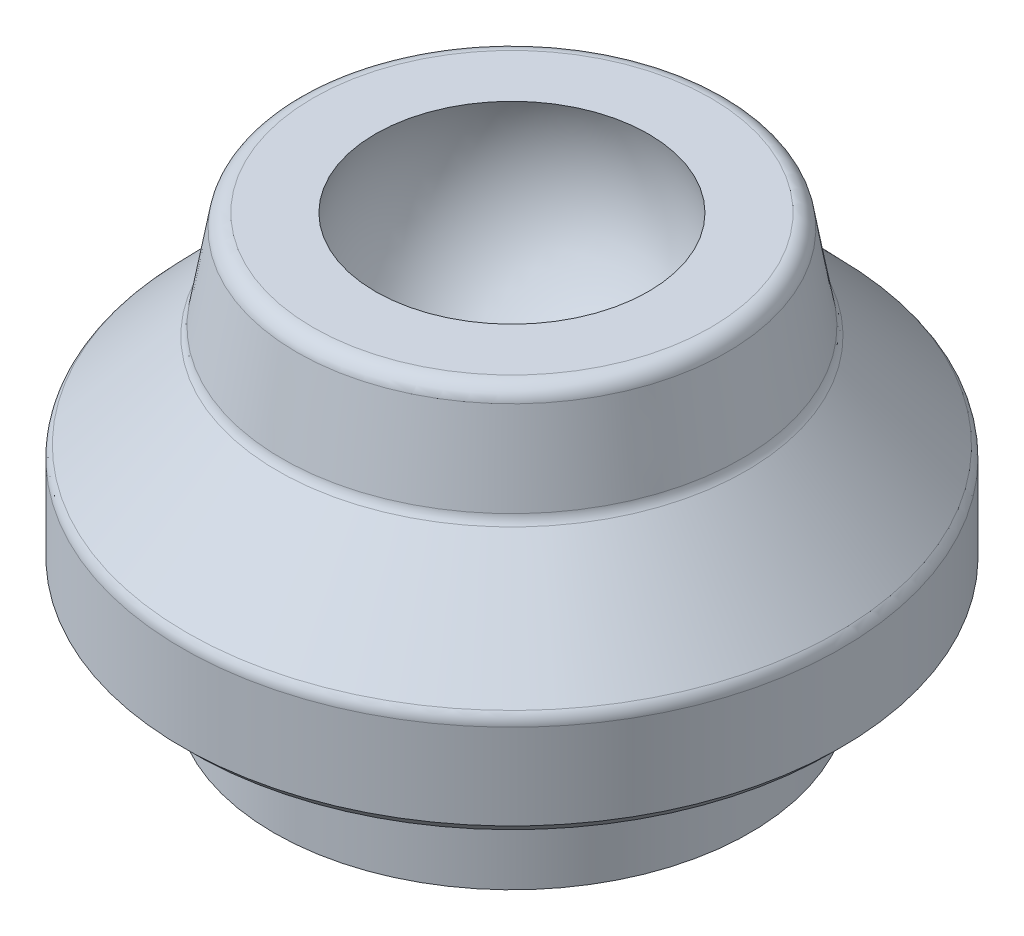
ISO-10303-21;
HEADER;
FILE_DESCRIPTION(('STEP AP214'),'2;1');
FILE_NAME('part.step','',(''),(''),'','','');
FILE_SCHEMA(('AUTOMOTIVE_DESIGN { 1 0 10303 214 1 1 1 1 }'));
ENDSEC;
DATA;
#1=APPLICATION_CONTEXT('core data for automotive mechanical design processes');
#2=APPLICATION_PROTOCOL_DEFINITION('international standard','automotive_design',2000,#1);
#3=PRODUCT_CONTEXT('',#1,'mechanical');
#4=PRODUCT('Part','Part','',(#3));
#5=PRODUCT_RELATED_PRODUCT_CATEGORY('part','',(#4));
#6=PRODUCT_DEFINITION_FORMATION('','',#4);
#7=PRODUCT_DEFINITION_CONTEXT('part definition',#1,'design');
#8=PRODUCT_DEFINITION('design','',#6,#7);
#9=PRODUCT_DEFINITION_SHAPE('','',#8);
#10=(LENGTH_UNIT() NAMED_UNIT(*) SI_UNIT(.MILLI.,.METRE.));
#11=(NAMED_UNIT(*) PLANE_ANGLE_UNIT() SI_UNIT($,.RADIAN.));
#12=(NAMED_UNIT(*) SI_UNIT($,.STERADIAN.) SOLID_ANGLE_UNIT());
#13=UNCERTAINTY_MEASURE_WITH_UNIT(LENGTH_MEASURE(1.E-05),#10,'distance_accuracy_value','');
#14=(GEOMETRIC_REPRESENTATION_CONTEXT(3) GLOBAL_UNCERTAINTY_ASSIGNED_CONTEXT((#13)) GLOBAL_UNIT_ASSIGNED_CONTEXT((#10,
#11,#12)) REPRESENTATION_CONTEXT('',''));
#15=CARTESIAN_POINT('',(0.,0.,0.));
#16=DIRECTION('',(0.,0.,1.));
#17=DIRECTION('',(1.,0.,0.));
#18=AXIS2_PLACEMENT_3D('',#15,#16,#17);
#19=CARTESIAN_POINT('',(0.,12.75,0.));
#20=DIRECTION('',(0.,-1.,0.));
#21=DIRECTION('',(-1.,0.,0.));
#22=AXIS2_PLACEMENT_3D('',#19,#20,#21);
#23=SPHERICAL_SURFACE('',#22,7.);
#24=CARTESIAN_POINT('',(0.,15.,0.));
#25=DIRECTION('',(0.,-1.,0.));
#26=DIRECTION('',(0.,0.,-1.));
#27=AXIS2_PLACEMENT_3D('',#24,#25,#26);
#28=CIRCLE('',#27,6.62853679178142);
#29=CARTESIAN_POINT('',(0.,15.,-6.62853679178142));
#30=VERTEX_POINT('',#29);
#31=EDGE_CURVE('E8',#30,#30,#28,.T.);
#32=ORIENTED_EDGE('',*,*,#31,.F.);
#33=EDGE_LOOP('',(#32));
#34=FACE_BOUND('',#33,.T.);
#35=ADVANCED_FACE('F12',(#34),#23,.F.);
#36=CARTESIAN_POINT('',(6.62853679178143,15.,0.));
#37=DIRECTION('',(0.,-1.,0.));
#38=DIRECTION('',(0.,0.,-1.));
#39=AXIS2_PLACEMENT_3D('',#36,#37,#38);
#40=PLANE('',#39);
#41=CARTESIAN_POINT('',(0.,15.,0.));
#42=DIRECTION('',(0.,-1.,0.));
#43=DIRECTION('',(0.,0.,-1.));
#44=AXIS2_PLACEMENT_3D('',#41,#42,#43);
#45=CIRCLE('',#44,9.65128088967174);
#46=CARTESIAN_POINT('',(0.,15.,-9.65128088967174));
#47=VERTEX_POINT('',#46);
#48=EDGE_CURVE('E18',#47,#47,#45,.T.);
#49=ORIENTED_EDGE('',*,*,#48,.F.);
#50=EDGE_LOOP('',(#49));
#51=FACE_BOUND('',#50,.T.);
#52=ORIENTED_EDGE('',*,*,#31,.T.);
#53=EDGE_LOOP('',(#52));
#54=FACE_BOUND('',#53,.T.);
#55=ADVANCED_FACE('F111',(#51,#54),#40,.F.);
#56=CARTESIAN_POINT('',(0.,14.205,0.));
#57=DIRECTION('',(0.,-1.,0.));
#58=DIRECTION('',(0.,0.,-1.));
#59=AXIS2_PLACEMENT_3D('',#56,#57,#58);
#60=TOROIDAL_SURFACE('',#59,9.65128088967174,0.795);
#61=ORIENTED_EDGE('',*,*,#48,.T.);
#62=EDGE_LOOP('',(#61));
#63=FACE_BOUND('',#62,.T.);
#64=CARTESIAN_POINT('',(0.,14.3430503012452,0.));
#65=DIRECTION('',(0.,-1.,0.));
#66=DIRECTION('',(0.,0.,-1.));
#67=AXIS2_PLACEMENT_3D('',#64,#65,#66);
#68=CIRCLE('',#67,10.4342030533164);
#69=CARTESIAN_POINT('',(0.,14.3430503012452,-10.4342030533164));
#70=VERTEX_POINT('',#69);
#71=EDGE_CURVE('E22',#70,#70,#68,.T.);
#72=ORIENTED_EDGE('',*,*,#71,.F.);
#73=EDGE_LOOP('',(#72));
#74=FACE_BOUND('',#73,.T.);
#75=ADVANCED_FACE('F117',(#63,#74),#60,.T.);
#76=CARTESIAN_POINT('',(0.,14.3430503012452,0.));
#77=DIRECTION('',(0.,-1.,0.));
#78=DIRECTION('',(0.,0.,-1.));
#79=AXIS2_PLACEMENT_3D('',#76,#77,#78);
#80=CONICAL_SURFACE('',#79,10.4342030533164,0.174532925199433);
#81=CARTESIAN_POINT('',(0.,10.2381002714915,0.));
#82=DIRECTION('',(0.,-1.,0.));
#83=DIRECTION('',(0.,0.,-1.));
#84=AXIS2_PLACEMENT_3D('',#81,#82,#83);
#85=CIRCLE('',#84,11.158016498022);
#86=CARTESIAN_POINT('',(0.,10.2381002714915,-11.158016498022));
#87=VERTEX_POINT('',#86);
#88=EDGE_CURVE('E26',#87,#87,#85,.T.);
#89=ORIENTED_EDGE('',*,*,#88,.F.);
#90=EDGE_LOOP('',(#89));
#91=FACE_BOUND('',#90,.T.);
#92=ORIENTED_EDGE('',*,*,#71,.T.);
#93=EDGE_LOOP('',(#92));
#94=FACE_BOUND('',#93,.T.);
#95=ADVANCED_FACE('F123',(#91,#94),#80,.T.);
#96=CARTESIAN_POINT('',(0.,10.3761505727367,0.));
#97=DIRECTION('',(0.,-1.,0.));
#98=DIRECTION('',(0.,0.,-1.));
#99=AXIS2_PLACEMENT_3D('',#96,#97,#98);
#100=TOROIDAL_SURFACE('',#99,11.9409386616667,0.795);
#101=CARTESIAN_POINT('',(0.,9.8255877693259,0.));
#102=DIRECTION('',(0.,-1.,0.));
#103=DIRECTION('',(0.,0.,-1.));
#104=AXIS2_PLACEMENT_3D('',#101,#102,#103);
#105=CIRCLE('',#104,11.3674357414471);
#106=CARTESIAN_POINT('',(0.,9.8255877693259,-11.3674357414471));
#107=VERTEX_POINT('',#106);
#108=EDGE_CURVE('E31',#107,#107,#105,.T.);
#109=ORIENTED_EDGE('',*,*,#108,.F.);
#110=EDGE_LOOP('',(#109));
#111=FACE_BOUND('',#110,.T.);
#112=ORIENTED_EDGE('',*,*,#88,.T.);
#113=EDGE_LOOP('',(#112));
#114=FACE_BOUND('',#113,.T.);
#115=ADVANCED_FACE('F107',(#111,#114),#100,.F.);
#116=CARTESIAN_POINT('',(0.,9.8255877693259,0.));
#117=DIRECTION('',(0.,-1.,0.));
#118=DIRECTION('',(0.,0.,-1.));
#119=AXIS2_PLACEMENT_3D('',#116,#117,#118);
#120=CONICAL_SURFACE('',#119,11.3674357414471,0.76499283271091);
#121=CARTESIAN_POINT('',(0.,5.23072612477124,0.));
#122=DIRECTION('',(0.,-1.,0.));
#123=DIRECTION('',(0.,0.,-1.));
#124=AXIS2_PLACEMENT_3D('',#121,#122,#123);
#125=CIRCLE('',#124,15.7785029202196);
#126=CARTESIAN_POINT('',(0.,5.23072612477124,-15.7785029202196));
#127=VERTEX_POINT('',#126);
#128=EDGE_CURVE('E34',#127,#127,#125,.T.);
#129=ORIENTED_EDGE('',*,*,#128,.F.);
#130=EDGE_LOOP('',(#129));
#131=FACE_BOUND('',#130,.T.);
#132=ORIENTED_EDGE('',*,*,#108,.T.);
#133=EDGE_LOOP('',(#132));
#134=FACE_BOUND('',#133,.T.);
#135=ADVANCED_FACE('F99',(#131,#134),#120,.T.);
#136=CARTESIAN_POINT('',(0.,4.68016332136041,0.));
#137=DIRECTION('',(0.,-1.,0.));
#138=DIRECTION('',(0.,0.,-1.));
#139=AXIS2_PLACEMENT_3D('',#136,#137,#138);
#140=TOROIDAL_SURFACE('',#139,15.205,0.795000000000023);
#141=ORIENTED_EDGE('',*,*,#128,.T.);
#142=EDGE_LOOP('',(#141));
#143=FACE_BOUND('',#142,.T.);
#144=CARTESIAN_POINT('',(0.,4.68016332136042,0.));
#145=DIRECTION('',(0.,-1.,0.));
#146=DIRECTION('',(0.,0.,-1.));
#147=AXIS2_PLACEMENT_3D('',#144,#145,#146);
#148=CIRCLE('',#147,16.);
#149=CARTESIAN_POINT('',(0.,4.68016332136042,-16.));
#150=VERTEX_POINT('',#149);
#151=EDGE_CURVE('E37',#150,#150,#148,.T.);
#152=ORIENTED_EDGE('',*,*,#151,.F.);
#153=EDGE_LOOP('',(#152));
#154=FACE_BOUND('',#153,.T.);
#155=ADVANCED_FACE('F94',(#143,#154),#140,.T.);
#156=CARTESIAN_POINT('',(0.,-5.3,0.));
#157=DIRECTION('',(0.,-1.,0.));
#158=DIRECTION('',(0.,0.,-1.));
#159=AXIS2_PLACEMENT_3D('',#156,#157,#158);
#160=CYLINDRICAL_SURFACE('',#159,16.);
#161=CARTESIAN_POINT('',(0.,0.53,0.));
#162=DIRECTION('',(0.,-1.,0.));
#163=DIRECTION('',(0.,0.,-1.));
#164=AXIS2_PLACEMENT_3D('',#161,#162,#163);
#165=CIRCLE('',#164,16.);
#166=CARTESIAN_POINT('',(0.,0.53,-16.));
#167=VERTEX_POINT('',#166);
#168=EDGE_CURVE('E40',#167,#167,#165,.T.);
#169=ORIENTED_EDGE('',*,*,#168,.F.);
#170=EDGE_LOOP('',(#169));
#171=FACE_BOUND('',#170,.T.);
#172=ORIENTED_EDGE('',*,*,#151,.T.);
#173=EDGE_LOOP('',(#172));
#174=FACE_BOUND('',#173,.T.);
#175=ADVANCED_FACE('F88',(#171,#174),#160,.T.);
#176=CARTESIAN_POINT('',(0.,0.53,0.));
#177=DIRECTION('',(0.,1.,0.));
#178=DIRECTION('',(0.,0.,1.));
#179=AXIS2_PLACEMENT_3D('',#176,#177,#178);
#180=CONICAL_SURFACE('',#179,16.,0.785398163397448);
#181=CARTESIAN_POINT('',(0.,0.,0.));
#182=DIRECTION('',(0.,-1.,0.));
#183=DIRECTION('',(0.,0.,-1.));
#184=AXIS2_PLACEMENT_3D('',#181,#182,#183);
#185=CIRCLE('',#184,15.47);
#186=CARTESIAN_POINT('',(0.,0.,-15.47));
#187=VERTEX_POINT('',#186);
#188=EDGE_CURVE('E43',#187,#187,#185,.T.);
#189=ORIENTED_EDGE('',*,*,#188,.F.);
#190=EDGE_LOOP('',(#189));
#191=FACE_BOUND('',#190,.T.);
#192=ORIENTED_EDGE('',*,*,#168,.T.);
#193=EDGE_LOOP('',(#192));
#194=FACE_BOUND('',#193,.T.);
#195=ADVANCED_FACE('F82',(#191,#194),#180,.T.);
#196=CARTESIAN_POINT('',(15.47,0.,0.));
#197=DIRECTION('',(0.,1.,0.));
#198=DIRECTION('',(0.,0.,1.));
#199=AXIS2_PLACEMENT_3D('',#196,#197,#198);
#200=PLANE('',#199);
#201=CARTESIAN_POINT('',(0.,0.,0.));
#202=DIRECTION('',(0.,-1.,0.));
#203=DIRECTION('',(0.,0.,-1.));
#204=AXIS2_PLACEMENT_3D('',#201,#202,#203);
#205=CIRCLE('',#204,11.55);
#206=CARTESIAN_POINT('',(0.,0.,-11.55));
#207=VERTEX_POINT('',#206);
#208=EDGE_CURVE('E46',#207,#207,#205,.T.);
#209=ORIENTED_EDGE('',*,*,#208,.F.);
#210=EDGE_LOOP('',(#209));
#211=FACE_BOUND('',#210,.T.);
#212=ORIENTED_EDGE('',*,*,#188,.T.);
#213=EDGE_LOOP('',(#212));
#214=FACE_BOUND('',#213,.T.);
#215=ADVANCED_FACE('F76',(#211,#214),#200,.F.);
#216=CARTESIAN_POINT('',(0.,-5.3,0.));
#217=DIRECTION('',(0.,-1.,0.));
#218=DIRECTION('',(0.,0.,-1.));
#219=AXIS2_PLACEMENT_3D('',#216,#217,#218);
#220=CYLINDRICAL_SURFACE('',#219,11.55);
#221=CARTESIAN_POINT('',(0.,-5.3,0.));
#222=DIRECTION('',(0.,-1.,0.));
#223=DIRECTION('',(0.,0.,-1.));
#224=AXIS2_PLACEMENT_3D('',#221,#222,#223);
#225=CIRCLE('',#224,11.55);
#226=CARTESIAN_POINT('',(0.,-5.3,-11.55));
#227=VERTEX_POINT('',#226);
#228=EDGE_CURVE('E49',#227,#227,#225,.T.);
#229=ORIENTED_EDGE('',*,*,#228,.F.);
#230=EDGE_LOOP('',(#229));
#231=FACE_BOUND('',#230,.T.);
#232=ORIENTED_EDGE('',*,*,#208,.T.);
#233=EDGE_LOOP('',(#232));
#234=FACE_BOUND('',#233,.T.);
#235=ADVANCED_FACE('F70',(#231,#234),#220,.T.);
#236=CARTESIAN_POINT('',(11.55,-5.3,0.));
#237=DIRECTION('',(0.,1.,0.));
#238=DIRECTION('',(0.,0.,1.));
#239=AXIS2_PLACEMENT_3D('',#236,#237,#238);
#240=PLANE('',#239);
#241=CARTESIAN_POINT('',(0.,-5.3,0.));
#242=DIRECTION('',(0.,-1.,0.));
#243=DIRECTION('',(0.,0.,-1.));
#244=AXIS2_PLACEMENT_3D('',#241,#242,#243);
#245=CIRCLE('',#244,7.65);
#246=CARTESIAN_POINT('',(0.,-5.3,-7.65));
#247=VERTEX_POINT('',#246);
#248=EDGE_CURVE('E53',#247,#247,#245,.T.);
#249=ORIENTED_EDGE('',*,*,#248,.F.);
#250=EDGE_LOOP('',(#249));
#251=FACE_BOUND('',#250,.T.);
#252=ORIENTED_EDGE('',*,*,#228,.T.);
#253=EDGE_LOOP('',(#252));
#254=FACE_BOUND('',#253,.T.);
#255=ADVANCED_FACE('F64',(#251,#254),#240,.F.);
#256=CARTESIAN_POINT('',(0.,0.,0.));
#257=DIRECTION('',(0.,-1.,0.));
#258=DIRECTION('',(0.,0.,-1.));
#259=AXIS2_PLACEMENT_3D('',#256,#257,#258);
#260=CYLINDRICAL_SURFACE('',#259,7.65);
#261=CARTESIAN_POINT('',(0.,0.,0.));
#262=DIRECTION('',(0.,-1.,0.));
#263=DIRECTION('',(0.,0.,-1.));
#264=AXIS2_PLACEMENT_3D('',#261,#262,#263);
#265=CIRCLE('',#264,7.65);
#266=CARTESIAN_POINT('',(0.,0.,-7.65));
#267=VERTEX_POINT('',#266);
#268=EDGE_CURVE('E52',#267,#267,#265,.T.);
#269=ORIENTED_EDGE('',*,*,#268,.F.);
#270=EDGE_LOOP('',(#269));
#271=FACE_BOUND('',#270,.T.);
#272=ORIENTED_EDGE('',*,*,#248,.T.);
#273=EDGE_LOOP('',(#272));
#274=FACE_BOUND('',#273,.T.);
#275=ADVANCED_FACE('F61',(#271,#274),#260,.F.);
#276=CARTESIAN_POINT('',(0.,0.,0.));
#277=DIRECTION('',(0.,-1.,0.));
#278=DIRECTION('',(0.,0.,-1.));
#279=AXIS2_PLACEMENT_3D('',#276,#277,#278);
#280=PLANE('',#279);
#281=ORIENTED_EDGE('',*,*,#268,.T.);
#282=EDGE_LOOP('',(#281));
#283=FACE_BOUND('',#282,.T.);
#284=ADVANCED_FACE('F59',(#283),#280,.T.);
#285=CLOSED_SHELL('',(#35,#55,#75,#95,#115,#135,#155,#175,#195,#215,#235,#255,#275,#284));
#286=MANIFOLD_SOLID_BREP('B1',#285);
#287=ADVANCED_BREP_SHAPE_REPRESENTATION('',(#18,#286),#14);
#288=SHAPE_DEFINITION_REPRESENTATION(#9,#287);
ENDSEC;
END-ISO-10303-21;
